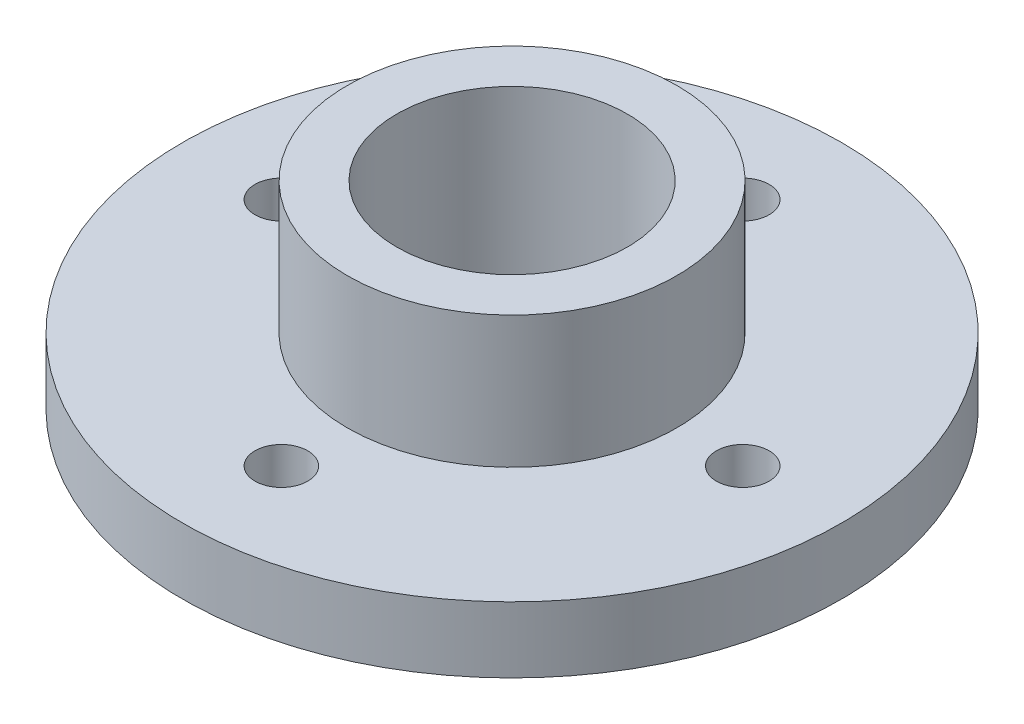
from build123d import *

# Parameters (mm, degrees)
HOLE_WIZARD_M2_1_D     = 1.6
HOLE_WIZARD_M2_1_DEPTH = 5.2
HOLE_WIZARD_M2_1_TIP   = 0.480688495
SKETCH_4_R             = 3.5
CUT_EXTRUDE_1_DEPTH    = 16.779733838


with BuildPart() as part:
    # Sketch 1 → Revolve 1 (revolve)
    with BuildSketch(Plane.XY, mode=Mode.PRIVATE) as revolve_1_sk:
        Polygon((0, 0), (10, 0), (10, 2), (5, 2), (5, 6), (3.5, 6), (3.5, 7), (0, 7), align=None)
    revolve(revolve_1_sk.sketch.rotate(Axis((0, 0, 0), (0, 1, 0)), 90), axis=Axis((0, 0, 0), (0, 1, 0)))

    # Hole Wizard M2 _1
    with Locations(Plane(origin=(0, 2, 0), x_dir=(1, 0, 0), z_dir=(0, 1, 0))):
        with Locations((0, 7), (0, -7), (7, 0), (-7, 0)):
            Hole(HOLE_WIZARD_M2_1_D / 2, depth=HOLE_WIZARD_M2_1_DEPTH)
            with Locations((0, 0, -(HOLE_WIZARD_M2_1_DEPTH + HOLE_WIZARD_M2_1_TIP / 2))):  # 118° drill point
                Cone(0, HOLE_WIZARD_M2_1_D / 2, HOLE_WIZARD_M2_1_TIP, mode=Mode.SUBTRACT)

    # Sketch 4 → Cut-Extrude 1 (cut, through all)
    with BuildSketch(Plane(origin=(0, 7, 0), x_dir=(1, 0, 0), z_dir=(0, 1, 0))):
        with Locations(Location((0, 0, 0), (0, 0, 270))):
            Circle(SKETCH_4_R)
    extrude(amount=-CUT_EXTRUDE_1_DEPTH, mode=Mode.SUBTRACT)


solid = part.part
